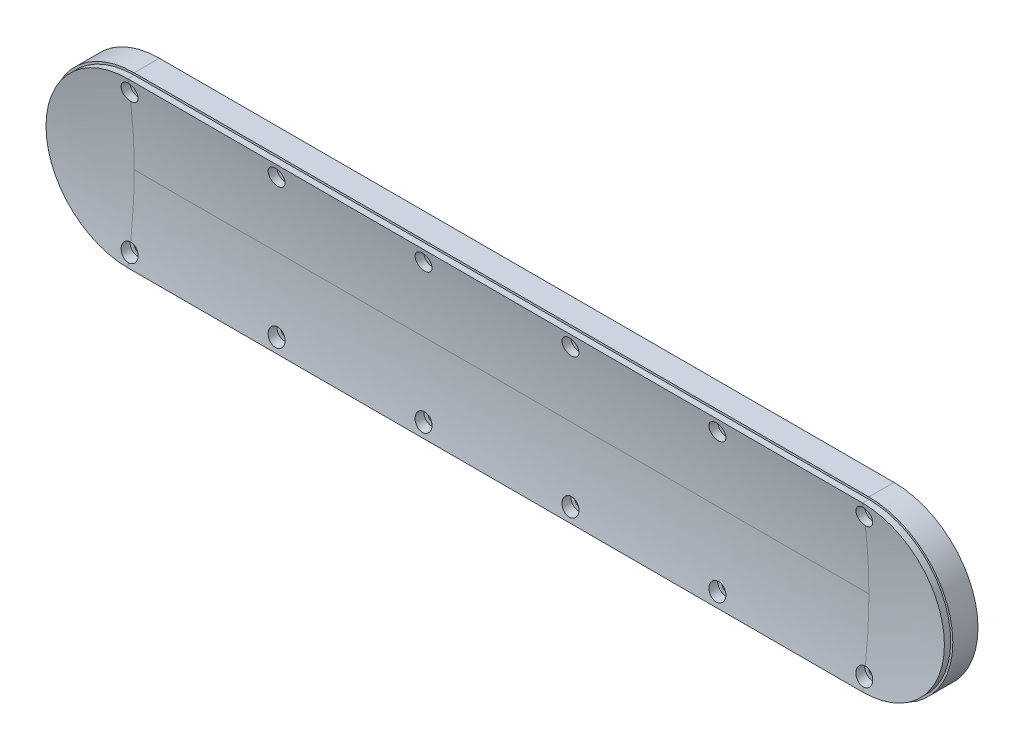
from build123d import *

# Parameters (mm, degrees)
DODANIE_WYCI_GNI_CIE1_DEPTH            = 12
DODANIE_WYCI_GNI_CIE2_DEPTH            = 3
WYTNIJ_WYCI_GNI_CIE1_DEPTH             = 350
WYTNIJ_WYCI_GNI_CIE2_REACH             = 234.594
SZKIC9_R                               = 2
WYTNIJ_WYCI_GNI_CIE2_DIRECTION_2_REACH = 234.594
SZYK_LINIOWY1_COUNT                    = 6
SZYK_LINIOWY1_PITCH                    = 70
LUSTRO1_COPY_1_REACH                   = 234.594
LUSTRO1_COPY_1_SKETCH_R                = 2
LUSTRO1_COPY_2_REACH                   = 234.594
LUSTRO1_COPY_2_SKETCH_R                = 2
LUSTRO1_COPY_3_REACH                   = 234.594
LUSTRO1_COPY_3_SKETCH_R                = 2
LUSTRO1_COPY_4_REACH                   = 234.594
LUSTRO1_COPY_4_SKETCH_R                = 2
LUSTRO1_COPY_5_REACH                   = 234.594
LUSTRO1_COPY_5_SKETCH_R                = 2
LUSTRO1_COPY_6_REACH                   = 234.594
LUSTRO1_COPY_6_SKETCH_R                = 2
LUSTRO1_COPY_7_REACH                   = 234.594
LUSTRO1_COPY_7_SKETCH_R                = 2
LUSTRO1_COPY_8_REACH                   = 234.594
LUSTRO1_COPY_8_SKETCH_R                = 2
LUSTRO1_COPY_9_REACH                   = 234.594
LUSTRO1_COPY_9_SKETCH_R                = 2
LUSTRO1_COPY_10_REACH                  = 234.594
LUSTRO1_COPY_10_SKETCH_R               = 2
SZKIC10_R                              = 4
WYTNIJ_WYCI_GNI_CIE3_DEPTH             = 233.59377249
SZYK_LINIOWY2_COUNT                    = 6
SZYK_LINIOWY2_PITCH                    = 70
LUSTRO2_COPY_1_SKETCH_R                = 4
LUSTRO2_COPY_1_DEPTH                   = 233.59377249
LUSTRO2_COPY_2_SKETCH_R                = 4
LUSTRO2_COPY_2_DEPTH                   = 233.59377249
LUSTRO2_COPY_3_SKETCH_R                = 4
LUSTRO2_COPY_3_DEPTH                   = 233.59377249
LUSTRO2_COPY_4_SKETCH_R                = 4
LUSTRO2_COPY_4_DEPTH                   = 233.59377249
LUSTRO2_COPY_5_SKETCH_R                = 4
LUSTRO2_COPY_5_DEPTH                   = 233.59377249


with BuildPart() as part:
    # Szkic1 → Dodanie-wyci_gni_cie1 (new body)
    with BuildSketch(Plane.XY):
        with BuildLine():
            Line((-168.756750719, 8.927588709), (181.243249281, 8.927588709))
            ThreePointArc((181.243249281, 8.927588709), (221.243249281, -31.072411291), (181.243249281, -71.072411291))
            Line((181.243249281, -71.072411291), (-168.756750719, -71.072411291))
            ThreePointArc((-168.756750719, -71.072411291), (-208.756750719, -31.072411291), (-168.756750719, 8.927588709))
        make_face()
    extrude(amount=DODANIE_WYCI_GNI_CIE1_DEPTH)

    # Szkic2 → Dodanie-wyci_gni_cie2 (add)
    with BuildSketch(Plane.XY.offset(12)):
        with BuildLine():
            Line((181.243249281, -70.072411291), (-168.756750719, -70.072411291))
            ThreePointArc((-168.756750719, -70.072411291), (-207.756750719, -31.072411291), (-168.756750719, 7.927588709))
            Line((-168.756750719, 7.927588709), (181.243249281, 7.927588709))
            ThreePointArc((181.243249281, 7.927588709), (220.243249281, -31.072411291), (181.243249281, -70.072411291))
        make_face()
    extrude(amount=DODANIE_WYCI_GNI_CIE2_DEPTH)

    # Szkic4 → Wyci_cie-obr_t1 (revolve, cut)
    with BuildSketch(Plane.ZY.offset(168.756750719)):
        with BuildLine():
            Line((15, -70.072411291), (15, -31.072411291))
            Line((15, -31.072411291), (12, -31.072411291))
            add(Edge.make_bspline(
                [(15, -70.072411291), (11.984514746, -50.687294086), (12, -31.072411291)],
                knots=[0, 0, 0, 1, 1, 1], degree=2))
        make_face()
    revolve(axis=Axis((-168.756750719, -31.072411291, 15), (0, 0, -1)), mode=Mode.SUBTRACT)

    # Szkic6 → Wytnij-wyci_gni_cie1 (cut)
    with BuildSketch(Plane.ZY.offset(168.756750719)):
        with BuildLine():
            Line((15, -70.072411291), (15, 7.927588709))
            add(Edge.make_bspline(
                [(15, 7.927588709), (11.984514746, -11.457528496), (12, -31.072411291)],
                knots=[0, 0, 0, 1, 1, 1], degree=2))
            add(Edge.make_bspline(
                [(15, -70.072411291), (11.984514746, -50.687294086), (12, -31.072411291)],
                knots=[0, 0, 0, 1, 1, 1], degree=2))
        make_face()
    extrude(amount=-WYTNIJ_WYCI_GNI_CIE1_DEPTH, mode=Mode.SUBTRACT)

    # Szkic8 → Wyci_cie-obr_t2 (revolve, cut)
    with BuildSketch(Plane.ZY.offset(-181.243249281)):
        with BuildLine():
            Line((15, -70.072411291), (15, -31.072411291))
            Line((15, -31.072411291), (12, -31.072411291))
            add(Edge.make_bspline(
                [(15, -70.072411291), (11.984514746, -50.687294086), (12, -31.072411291)],
                knots=[0, 0, 0, 1, 1, 1], degree=2))
        make_face()
    revolve(axis=Axis((181.243249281, -31.072411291, 12), (0, 0, 1)), mode=Mode.SUBTRACT)

    # Szkic9 → Wytnij-wyci_gni_cie2 (cut, up to next)
    with BuildSketch(Plane.XY.offset(10), mode=Mode.PRIVATE) as wytnij_wyci_gni_cie2_sk1:
        with Locations(Location((181.243249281, -64.072411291, 0), (0, 0, 270))):
            Circle(SZKIC9_R)
    wytnij_wyci_gni_cie2_tool1 = extrude(wytnij_wyci_gni_cie2_sk1.sketch, amount=-WYTNIJ_WYCI_GNI_CIE2_REACH, mode=Mode.PRIVATE) & part.part
    wytnij_wyci_gni_cie2 = wytnij_wyci_gni_cie2_tool1.solids().sort_by_distance((181.243249, -64.072411, 10))[0]
    add(wytnij_wyci_gni_cie2, mode=Mode.SUBTRACT)

    # Szkic9 → Wytnij-wyci_gni_cie2 direction 2 (cut, up to next)
    with BuildSketch(Plane.XY.offset(10), mode=Mode.PRIVATE) as wytnij_wyci_gni_cie2_direction_2_sk1:
        with Locations(Location((181.243249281, -64.072411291, 0), (0, 0, 270))):
            Circle(SZKIC9_R)
    wytnij_wyci_gni_cie2_direction_2_tool1 = extrude(wytnij_wyci_gni_cie2_direction_2_sk1.sketch, amount=WYTNIJ_WYCI_GNI_CIE2_DIRECTION_2_REACH, mode=Mode.PRIVATE) & part.part
    wytnij_wyci_gni_cie2_direction_2 = wytnij_wyci_gni_cie2_direction_2_tool1.solids().sort_by_distance((181.243249, -64.072411, 10))[0]
    add(wytnij_wyci_gni_cie2_direction_2, mode=Mode.SUBTRACT)

    # Szyk liniowy1: Wytnij-wyci_gni_cie2, Wytnij-wyci_gni_cie2 direction 2; each copy of Wytnij-wyci_gni_cie2, Wytnij-wyci_gni_cie2 direction 2 runs up to whatever stops it at its own place
    szyk_liniowy1_before = part.part  # the part as the pattern finds it: every copy runs up to it
    szyk_liniowy1_wytnij_wyci_gni_cie2_long = extrude(wytnij_wyci_gni_cie2_sk1.sketch, amount=-WYTNIJ_WYCI_GNI_CIE2_REACH, mode=Mode.PRIVATE)
    szyk_liniowy1_wytnij_wyci_gni_cie2_tool1 = szyk_liniowy1_wytnij_wyci_gni_cie2_long.moved(Location(Vector(-1, 0, 0) * (1 * SZYK_LINIOWY1_PITCH))) & szyk_liniowy1_before
    add(szyk_liniowy1_wytnij_wyci_gni_cie2_tool1.solids().sort_by_distance((111.243249, -64.072411, 10))[0], mode=Mode.SUBTRACT)
    szyk_liniowy1_wytnij_wyci_gni_cie2_tool2 = szyk_liniowy1_wytnij_wyci_gni_cie2_long.moved(Location(Vector(-1, 0, 0) * (2 * SZYK_LINIOWY1_PITCH))) & szyk_liniowy1_before
    add(szyk_liniowy1_wytnij_wyci_gni_cie2_tool2.solids().sort_by_distance((41.243249, -64.072411, 10))[0], mode=Mode.SUBTRACT)
    szyk_liniowy1_wytnij_wyci_gni_cie2_tool3 = szyk_liniowy1_wytnij_wyci_gni_cie2_long.moved(Location(Vector(-1, 0, 0) * (3 * SZYK_LINIOWY1_PITCH))) & szyk_liniowy1_before
    add(szyk_liniowy1_wytnij_wyci_gni_cie2_tool3.solids().sort_by_distance((-28.756751, -64.072411, 10))[0], mode=Mode.SUBTRACT)
    szyk_liniowy1_wytnij_wyci_gni_cie2_tool4 = szyk_liniowy1_wytnij_wyci_gni_cie2_long.moved(Location(Vector(-1, 0, 0) * (4 * SZYK_LINIOWY1_PITCH))) & szyk_liniowy1_before
    add(szyk_liniowy1_wytnij_wyci_gni_cie2_tool4.solids().sort_by_distance((-98.756751, -64.072411, 10))[0], mode=Mode.SUBTRACT)
    szyk_liniowy1_wytnij_wyci_gni_cie2_tool5 = szyk_liniowy1_wytnij_wyci_gni_cie2_long.moved(Location(Vector(-1, 0, 0) * (5 * SZYK_LINIOWY1_PITCH))) & szyk_liniowy1_before
    add(szyk_liniowy1_wytnij_wyci_gni_cie2_tool5.solids().sort_by_distance((-168.756751, -64.072411, 10))[0], mode=Mode.SUBTRACT)
    szyk_liniowy1_wytnij_wyci_gni_cie2_direction_2_long = extrude(wytnij_wyci_gni_cie2_direction_2_sk1.sketch, amount=WYTNIJ_WYCI_GNI_CIE2_DIRECTION_2_REACH, mode=Mode.PRIVATE)
    szyk_liniowy1_wytnij_wyci_gni_cie2_direction_2_tool1 = szyk_liniowy1_wytnij_wyci_gni_cie2_direction_2_long.moved(Location(Vector(-1, 0, 0) * (1 * SZYK_LINIOWY1_PITCH))) & szyk_liniowy1_before
    add(szyk_liniowy1_wytnij_wyci_gni_cie2_direction_2_tool1.solids().sort_by_distance((111.243249, -64.072411, 10))[0], mode=Mode.SUBTRACT)
    szyk_liniowy1_wytnij_wyci_gni_cie2_direction_2_tool2 = szyk_liniowy1_wytnij_wyci_gni_cie2_direction_2_long.moved(Location(Vector(-1, 0, 0) * (2 * SZYK_LINIOWY1_PITCH))) & szyk_liniowy1_before
    add(szyk_liniowy1_wytnij_wyci_gni_cie2_direction_2_tool2.solids().sort_by_distance((41.243249, -64.072411, 10))[0], mode=Mode.SUBTRACT)
    szyk_liniowy1_wytnij_wyci_gni_cie2_direction_2_tool3 = szyk_liniowy1_wytnij_wyci_gni_cie2_direction_2_long.moved(Location(Vector(-1, 0, 0) * (3 * SZYK_LINIOWY1_PITCH))) & szyk_liniowy1_before
    add(szyk_liniowy1_wytnij_wyci_gni_cie2_direction_2_tool3.solids().sort_by_distance((-28.756751, -64.072411, 10))[0], mode=Mode.SUBTRACT)
    szyk_liniowy1_wytnij_wyci_gni_cie2_direction_2_tool4 = szyk_liniowy1_wytnij_wyci_gni_cie2_direction_2_long.moved(Location(Vector(-1, 0, 0) * (4 * SZYK_LINIOWY1_PITCH))) & szyk_liniowy1_before
    add(szyk_liniowy1_wytnij_wyci_gni_cie2_direction_2_tool4.solids().sort_by_distance((-98.756751, -64.072411, 10))[0], mode=Mode.SUBTRACT)
    szyk_liniowy1_wytnij_wyci_gni_cie2_direction_2_tool5 = szyk_liniowy1_wytnij_wyci_gni_cie2_direction_2_long.moved(Location(Vector(-1, 0, 0) * (5 * SZYK_LINIOWY1_PITCH))) & szyk_liniowy1_before
    add(szyk_liniowy1_wytnij_wyci_gni_cie2_direction_2_tool5.solids().sort_by_distance((-168.756751, -64.072411, 10))[0], mode=Mode.SUBTRACT)

    # Lustro1: Wytnij-wyci_gni_cie2, Wytnij-wyci_gni_cie2 direction 2 across plane
    add(wytnij_wyci_gni_cie2.mirror(Plane.ZX.offset(-31.072411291)), mode=Mode.SUBTRACT)
    add(wytnij_wyci_gni_cie2_direction_2.mirror(Plane.ZX.offset(-31.072411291)), mode=Mode.SUBTRACT)

    # Lustro1 copy 1 sketch → Lustro1 copy 1 (cut, up to next)
    with BuildSketch(Plane(origin=(-70, -62.144822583, 10), x_dir=(1, 0, 0), z_dir=(0, 0, 1)), mode=Mode.PRIVATE) as lustro1_copy_1_sk1:
        with Locations((181.243249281, 64.072411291)):
            Circle(LUSTRO1_COPY_1_SKETCH_R)
    lustro1_copy_1_tool1 = extrude(lustro1_copy_1_sk1.sketch, amount=-LUSTRO1_COPY_1_REACH, mode=Mode.PRIVATE) & part.part
    add(lustro1_copy_1_tool1.solids().sort_by_distance((111.243249, 1.927588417, 10))[0], mode=Mode.SUBTRACT)

    # Lustro1 copy 2 sketch → Lustro1 copy 2 (cut, up to next)
    with BuildSketch(Plane(origin=(-140, -62.144822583, 10), x_dir=(1, 0, 0), z_dir=(0, 0, 1)), mode=Mode.PRIVATE) as lustro1_copy_2_sk1:
        with Locations((181.243249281, 64.072411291)):
            Circle(LUSTRO1_COPY_2_SKETCH_R)
    lustro1_copy_2_tool1 = extrude(lustro1_copy_2_sk1.sketch, amount=-LUSTRO1_COPY_2_REACH, mode=Mode.PRIVATE) & part.part
    add(lustro1_copy_2_tool1.solids().sort_by_distance((41.243249, 1.927588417, 10))[0], mode=Mode.SUBTRACT)

    # Lustro1 copy 3 sketch → Lustro1 copy 3 (cut, up to next)
    with BuildSketch(Plane(origin=(-210, -62.144822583, 10), x_dir=(1, 0, 0), z_dir=(0, 0, 1)), mode=Mode.PRIVATE) as lustro1_copy_3_sk1:
        with Locations((181.243249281, 64.072411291)):
            Circle(LUSTRO1_COPY_3_SKETCH_R)
    lustro1_copy_3_tool1 = extrude(lustro1_copy_3_sk1.sketch, amount=-LUSTRO1_COPY_3_REACH, mode=Mode.PRIVATE) & part.part
    add(lustro1_copy_3_tool1.solids().sort_by_distance((-28.756751, 1.927588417, 10))[0], mode=Mode.SUBTRACT)

    # Lustro1 copy 4 sketch → Lustro1 copy 4 (cut, up to next)
    with BuildSketch(Plane(origin=(-280, -62.144822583, 10), x_dir=(1, 0, 0), z_dir=(0, 0, 1)), mode=Mode.PRIVATE) as lustro1_copy_4_sk1:
        with Locations((181.243249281, 64.072411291)):
            Circle(LUSTRO1_COPY_4_SKETCH_R)
    lustro1_copy_4_tool1 = extrude(lustro1_copy_4_sk1.sketch, amount=-LUSTRO1_COPY_4_REACH, mode=Mode.PRIVATE) & part.part
    add(lustro1_copy_4_tool1.solids().sort_by_distance((-98.756751, 1.927588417, 10))[0], mode=Mode.SUBTRACT)

    # Lustro1 copy 5 sketch → Lustro1 copy 5 (cut, up to next)
    with BuildSketch(Plane(origin=(-350, -62.144822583, 10), x_dir=(1, 0, 0), z_dir=(0, 0, 1)), mode=Mode.PRIVATE) as lustro1_copy_5_sk1:
        with Locations((181.243249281, 64.072411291)):
            Circle(LUSTRO1_COPY_5_SKETCH_R)
    lustro1_copy_5_tool1 = extrude(lustro1_copy_5_sk1.sketch, amount=-LUSTRO1_COPY_5_REACH, mode=Mode.PRIVATE) & part.part
    add(lustro1_copy_5_tool1.solids().sort_by_distance((-168.756751, 1.927588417, 10))[0], mode=Mode.SUBTRACT)

    # Lustro1 copy 6 sketch → Lustro1 copy 6 (cut, up to next)
    with BuildSketch(Plane(origin=(-70, -62.144822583, 10), x_dir=(1, 0, 0), z_dir=(0, 0, 1)), mode=Mode.PRIVATE) as lustro1_copy_6_sk1:
        with Locations((181.243249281, 64.072411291)):
            Circle(LUSTRO1_COPY_6_SKETCH_R)
    lustro1_copy_6_tool1 = extrude(lustro1_copy_6_sk1.sketch, amount=LUSTRO1_COPY_6_REACH, mode=Mode.PRIVATE) & part.part
    add(lustro1_copy_6_tool1.solids().sort_by_distance((111.243249, 1.927588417, 10))[0], mode=Mode.SUBTRACT)

    # Lustro1 copy 7 sketch → Lustro1 copy 7 (cut, up to next)
    with BuildSketch(Plane(origin=(-140, -62.144822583, 10), x_dir=(1, 0, 0), z_dir=(0, 0, 1)), mode=Mode.PRIVATE) as lustro1_copy_7_sk1:
        with Locations((181.243249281, 64.072411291)):
            Circle(LUSTRO1_COPY_7_SKETCH_R)
    lustro1_copy_7_tool1 = extrude(lustro1_copy_7_sk1.sketch, amount=LUSTRO1_COPY_7_REACH, mode=Mode.PRIVATE) & part.part
    add(lustro1_copy_7_tool1.solids().sort_by_distance((41.243249, 1.927588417, 10))[0], mode=Mode.SUBTRACT)

    # Lustro1 copy 8 sketch → Lustro1 copy 8 (cut, up to next)
    with BuildSketch(Plane(origin=(-210, -62.144822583, 10), x_dir=(1, 0, 0), z_dir=(0, 0, 1)), mode=Mode.PRIVATE) as lustro1_copy_8_sk1:
        with Locations((181.243249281, 64.072411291)):
            Circle(LUSTRO1_COPY_8_SKETCH_R)
    lustro1_copy_8_tool1 = extrude(lustro1_copy_8_sk1.sketch, amount=LUSTRO1_COPY_8_REACH, mode=Mode.PRIVATE) & part.part
    add(lustro1_copy_8_tool1.solids().sort_by_distance((-28.756751, 1.927588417, 10))[0], mode=Mode.SUBTRACT)

    # Lustro1 copy 9 sketch → Lustro1 copy 9 (cut, up to next)
    with BuildSketch(Plane(origin=(-280, -62.144822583, 10), x_dir=(1, 0, 0), z_dir=(0, 0, 1)), mode=Mode.PRIVATE) as lustro1_copy_9_sk1:
        with Locations((181.243249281, 64.072411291)):
            Circle(LUSTRO1_COPY_9_SKETCH_R)
    lustro1_copy_9_tool1 = extrude(lustro1_copy_9_sk1.sketch, amount=LUSTRO1_COPY_9_REACH, mode=Mode.PRIVATE) & part.part
    add(lustro1_copy_9_tool1.solids().sort_by_distance((-98.756751, 1.927588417, 10))[0], mode=Mode.SUBTRACT)

    # Lustro1 copy 10 sketch → Lustro1 copy 10 (cut, up to next)
    with BuildSketch(Plane(origin=(-350, -62.144822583, 10), x_dir=(1, 0, 0), z_dir=(0, 0, 1)), mode=Mode.PRIVATE) as lustro1_copy_10_sk1:
        with Locations((181.243249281, 64.072411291)):
            Circle(LUSTRO1_COPY_10_SKETCH_R)
    lustro1_copy_10_tool1 = extrude(lustro1_copy_10_sk1.sketch, amount=LUSTRO1_COPY_10_REACH, mode=Mode.PRIVATE) & part.part
    add(lustro1_copy_10_tool1.solids().sort_by_distance((-168.756751, 1.927588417, 10))[0], mode=Mode.SUBTRACT)

    # Szkic10 → Wytnij-wyci_gni_cie3 (cut, through all)
    with BuildSketch(Plane.XY.offset(10)):
        with Locations(Location((181.243249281, -64.072411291, 0), (0, 0, 90))):
            Circle(SZKIC10_R)
    wytnij_wyci_gni_cie3 = extrude(amount=WYTNIJ_WYCI_GNI_CIE3_DEPTH, mode=Mode.SUBTRACT)

    # Szyk liniowy2: Wytnij-wyci_gni_cie3 ×6
    with Locations(*[(-i * SZYK_LINIOWY2_PITCH, 0, 0) for i in range(1, SZYK_LINIOWY2_COUNT)]):
        add(wytnij_wyci_gni_cie3, mode=Mode.SUBTRACT)

    # Lustro2: Wytnij-wyci_gni_cie3 across plane
    add(wytnij_wyci_gni_cie3.mirror(Plane.ZX.offset(-31.072411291)), mode=Mode.SUBTRACT)

    # Lustro2 copy 1 sketch → Lustro2 copy 1 (cut, through all)
    with BuildSketch(Plane(origin=(-70, -62.144822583, 10), x_dir=(1, 0, 0), z_dir=(0, 0, 1))):
        with Locations((181.243249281, 64.072411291)):
            Circle(LUSTRO2_COPY_1_SKETCH_R)
    extrude(amount=LUSTRO2_COPY_1_DEPTH, mode=Mode.SUBTRACT)

    # Lustro2 copy 2 sketch → Lustro2 copy 2 (cut, through all)
    with BuildSketch(Plane(origin=(-140, -62.144822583, 10), x_dir=(1, 0, 0), z_dir=(0, 0, 1))):
        with Locations((181.243249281, 64.072411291)):
            Circle(LUSTRO2_COPY_2_SKETCH_R)
    extrude(amount=LUSTRO2_COPY_2_DEPTH, mode=Mode.SUBTRACT)

    # Lustro2 copy 3 sketch → Lustro2 copy 3 (cut, through all)
    with BuildSketch(Plane(origin=(-210, -62.144822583, 10), x_dir=(1, 0, 0), z_dir=(0, 0, 1))):
        with Locations((181.243249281, 64.072411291)):
            Circle(LUSTRO2_COPY_3_SKETCH_R)
    extrude(amount=LUSTRO2_COPY_3_DEPTH, mode=Mode.SUBTRACT)

    # Lustro2 copy 4 sketch → Lustro2 copy 4 (cut, through all)
    with BuildSketch(Plane(origin=(-280, -62.144822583, 10), x_dir=(1, 0, 0), z_dir=(0, 0, 1))):
        with Locations((181.243249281, 64.072411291)):
            Circle(LUSTRO2_COPY_4_SKETCH_R)
    extrude(amount=LUSTRO2_COPY_4_DEPTH, mode=Mode.SUBTRACT)

    # Lustro2 copy 5 sketch → Lustro2 copy 5 (cut, through all)
    with BuildSketch(Plane(origin=(-350, -62.144822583, 10), x_dir=(1, 0, 0), z_dir=(0, 0, 1))):
        with Locations((181.243249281, 64.072411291)):
            Circle(LUSTRO2_COPY_5_SKETCH_R)
    extrude(amount=LUSTRO2_COPY_5_DEPTH, mode=Mode.SUBTRACT)


solid = part.part
